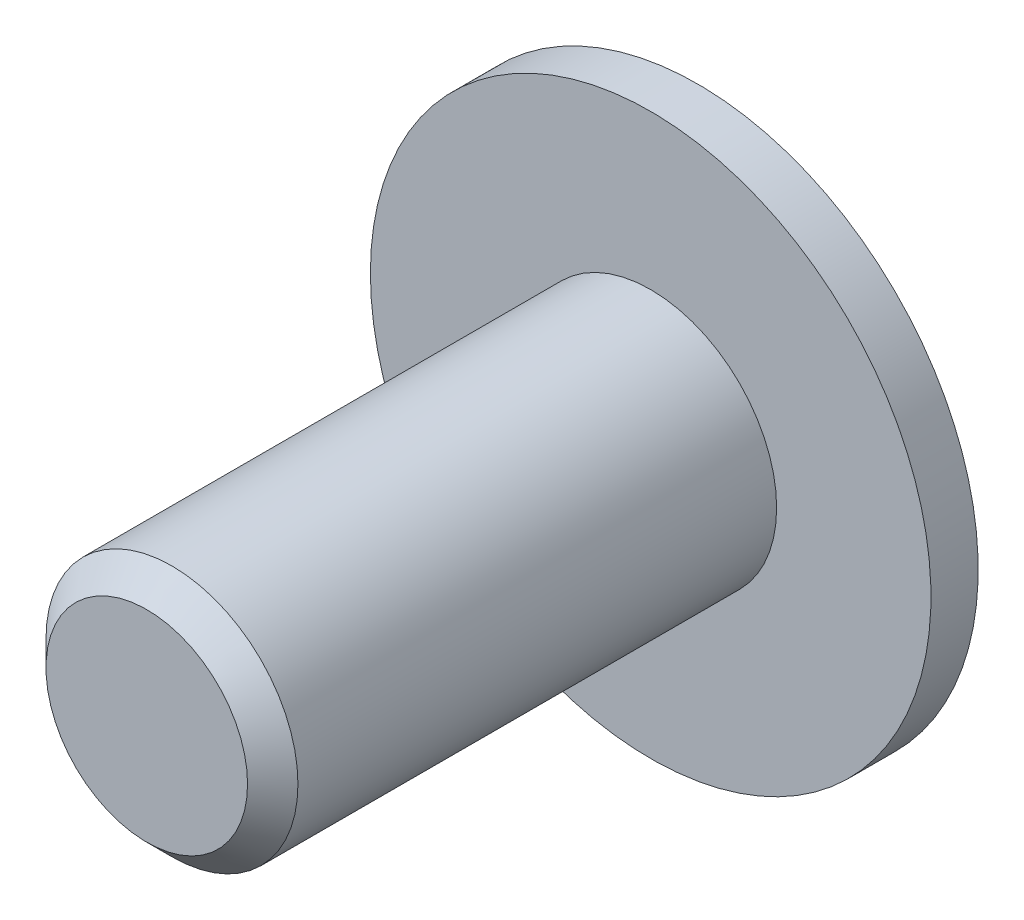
ISO-10303-21;
HEADER;
FILE_DESCRIPTION(('STEP AP214'),'2;1');
FILE_NAME('part.step','',(''),(''),'','','');
FILE_SCHEMA(('AUTOMOTIVE_DESIGN { 1 0 10303 214 1 1 1 1 }'));
ENDSEC;
DATA;
#1=APPLICATION_CONTEXT('core data for automotive mechanical design processes');
#2=APPLICATION_PROTOCOL_DEFINITION('international standard','automotive_design',2000,#1);
#3=PRODUCT_CONTEXT('',#1,'mechanical');
#4=PRODUCT('Part','Part','',(#3));
#5=PRODUCT_RELATED_PRODUCT_CATEGORY('part','',(#4));
#6=PRODUCT_DEFINITION_FORMATION('','',#4);
#7=PRODUCT_DEFINITION_CONTEXT('part definition',#1,'design');
#8=PRODUCT_DEFINITION('design','',#6,#7);
#9=PRODUCT_DEFINITION_SHAPE('','',#8);
#10=(LENGTH_UNIT() NAMED_UNIT(*) SI_UNIT(.MILLI.,.METRE.));
#11=(NAMED_UNIT(*) PLANE_ANGLE_UNIT() SI_UNIT($,.RADIAN.));
#12=(NAMED_UNIT(*) SI_UNIT($,.STERADIAN.) SOLID_ANGLE_UNIT());
#13=UNCERTAINTY_MEASURE_WITH_UNIT(LENGTH_MEASURE(1.E-05),#10,'distance_accuracy_value','');
#14=(GEOMETRIC_REPRESENTATION_CONTEXT(3) GLOBAL_UNCERTAINTY_ASSIGNED_CONTEXT((#13)) GLOBAL_UNIT_ASSIGNED_CONTEXT((#10,
#11,#12)) REPRESENTATION_CONTEXT('',''));
#15=CARTESIAN_POINT('',(0.,0.,0.));
#16=DIRECTION('',(0.,0.,1.));
#17=DIRECTION('',(1.,0.,0.));
#18=AXIS2_PLACEMENT_3D('',#15,#16,#17);
#19=CARTESIAN_POINT('',(0.,0.,-4.40000000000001));
#20=DIRECTION('',(0.,0.,1.));
#21=DIRECTION('',(1.,0.,0.));
#22=AXIS2_PLACEMENT_3D('',#19,#20,#21);
#23=PLANE('',#22);
#24=CARTESIAN_POINT('',(0.,0.,-4.40000000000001));
#25=DIRECTION('',(0.,0.,-1.));
#26=DIRECTION('',(-1.,0.,0.));
#27=AXIS2_PLACEMENT_3D('',#24,#25,#26);
#28=CIRCLE('',#27,4.06492341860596);
#29=CARTESIAN_POINT('',(-4.06492341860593,0.,-4.40000000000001));
#30=VERTEX_POINT('',#29);
#31=EDGE_CURVE('E150',#30,#30,#28,.T.);
#32=ORIENTED_EDGE('',*,*,#31,.T.);
#33=EDGE_LOOP('',(#32));
#34=FACE_BOUND('',#33,.T.);
#35=DIRECTION('',(-0.86602540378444,0.499999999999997,0.));
#36=VECTOR('',#35,1.);
#37=CARTESIAN_POINT('',(0.,2.88675134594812,-4.40000000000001));
#38=LINE('',#37,#36);
#39=CARTESIAN_POINT('',(2.50000000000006,1.44337567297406,-4.40000000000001));
#40=VERTEX_POINT('',#39);
#41=CARTESIAN_POINT('',(0.,2.88675134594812,-4.40000000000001));
#42=VERTEX_POINT('',#41);
#43=EDGE_CURVE('E49',#40,#42,#38,.T.);
#44=ORIENTED_EDGE('',*,*,#43,.T.);
#45=DIRECTION('',(-0.866025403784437,-0.500000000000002,0.));
#46=VECTOR('',#45,1.);
#47=CARTESIAN_POINT('',(0.,2.88675134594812,-4.40000000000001));
#48=LINE('',#47,#46);
#49=CARTESIAN_POINT('',(-2.49999999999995,1.44337567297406,-4.40000000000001));
#50=VERTEX_POINT('',#49);
#51=EDGE_CURVE('E120',#42,#50,#48,.T.);
#52=ORIENTED_EDGE('',*,*,#51,.T.);
#53=DIRECTION('',(0.,-1.,0.));
#54=VECTOR('',#53,1.);
#55=CARTESIAN_POINT('',(-2.49999999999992,-1.44337567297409,-4.40000000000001));
#56=LINE('',#55,#54);
#57=CARTESIAN_POINT('',(-2.49999999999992,-1.44337567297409,-4.40000000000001));
#58=VERTEX_POINT('',#57);
#59=EDGE_CURVE('E124',#50,#58,#56,.T.);
#60=ORIENTED_EDGE('',*,*,#59,.T.);
#61=DIRECTION('',(0.866025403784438,-0.500000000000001,0.));
#62=VECTOR('',#61,1.);
#63=CARTESIAN_POINT('',(0.,-2.88675134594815,-4.40000000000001));
#64=LINE('',#63,#62);
#65=CARTESIAN_POINT('',(0.,-2.88675134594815,-4.40000000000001));
#66=VERTEX_POINT('',#65);
#67=EDGE_CURVE('E127',#58,#66,#64,.T.);
#68=ORIENTED_EDGE('',*,*,#67,.T.);
#69=DIRECTION('',(0.86602540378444,0.499999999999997,0.));
#70=VECTOR('',#69,1.);
#71=CARTESIAN_POINT('',(0.,-2.88675134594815,-4.40000000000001));
#72=LINE('',#71,#70);
#73=CARTESIAN_POINT('',(2.50000000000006,-1.44337567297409,-4.40000000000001));
#74=VERTEX_POINT('',#73);
#75=EDGE_CURVE('E110',#66,#74,#72,.T.);
#76=ORIENTED_EDGE('',*,*,#75,.T.);
#77=DIRECTION('',(0.,1.,0.));
#78=VECTOR('',#77,1.);
#79=CARTESIAN_POINT('',(2.50000000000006,-1.44337567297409,-4.40000000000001));
#80=LINE('',#79,#78);
#81=EDGE_CURVE('E130',#74,#40,#80,.T.);
#82=ORIENTED_EDGE('',*,*,#81,.T.);
#83=EDGE_LOOP('',(#44,#52,#60,#68,#76,#82));
#84=FACE_BOUND('',#83,.T.);
#85=ADVANCED_FACE('F34',(#34,#84),#23,.F.);
#86=CARTESIAN_POINT('',(0.,0.,-0.574933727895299));
#87=DIRECTION('',(0.,0.,-1.));
#88=DIRECTION('',(-1.,0.,0.));
#89=AXIS2_PLACEMENT_3D('',#86,#87,#88);
#90=DEGENERATE_TOROIDAL_SURFACE('',#89,3.04,3.96,.T.);
#91=ORIENTED_EDGE('',*,*,#31,.F.);
#92=EDGE_LOOP('',(#91));
#93=FACE_BOUND('',#92,.T.);
#94=CARTESIAN_POINT('',(0.,0.,-1.5));
#95=DIRECTION('',(0.,0.,-1.));
#96=DIRECTION('',(-1.,0.,0.));
#97=AXIS2_PLACEMENT_3D('',#94,#95,#96);
#98=CIRCLE('',#97,6.8904353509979);
#99=CARTESIAN_POINT('',(-6.89043535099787,0.,-1.5));
#100=VERTEX_POINT('',#99);
#101=EDGE_CURVE('E147',#100,#100,#98,.T.);
#102=ORIENTED_EDGE('',*,*,#101,.T.);
#103=EDGE_LOOP('',(#102));
#104=FACE_BOUND('',#103,.T.);
#105=ADVANCED_FACE('F167',(#93,#104),#90,.T.);
#106=CARTESIAN_POINT('',(8.90000000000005,0.,-1.5));
#107=DIRECTION('',(0.,0.,1.));
#108=DIRECTION('',(1.,0.,0.));
#109=AXIS2_PLACEMENT_3D('',#106,#107,#108);
#110=PLANE('',#109);
#111=ORIENTED_EDGE('',*,*,#101,.F.);
#112=EDGE_LOOP('',(#111));
#113=FACE_BOUND('',#112,.T.);
#114=CARTESIAN_POINT('',(0.,0.,-1.5));
#115=DIRECTION('',(0.,0.,-1.));
#116=DIRECTION('',(-1.,0.,0.));
#117=AXIS2_PLACEMENT_3D('',#114,#115,#116);
#118=CIRCLE('',#117,8.9);
#119=CARTESIAN_POINT('',(-8.89999999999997,0.,-1.5));
#120=VERTEX_POINT('',#119);
#121=EDGE_CURVE('E144',#120,#120,#118,.T.);
#122=ORIENTED_EDGE('',*,*,#121,.T.);
#123=EDGE_LOOP('',(#122));
#124=FACE_BOUND('',#123,.T.);
#125=ADVANCED_FACE('F172',(#113,#124),#110,.F.);
#126=CARTESIAN_POINT('',(0.,0.,0.));
#127=DIRECTION('',(0.,0.,-1.));
#128=DIRECTION('',(-1.,0.,0.));
#129=AXIS2_PLACEMENT_3D('',#126,#127,#128);
#130=CYLINDRICAL_SURFACE('',#129,8.9);
#131=ORIENTED_EDGE('',*,*,#121,.F.);
#132=EDGE_LOOP('',(#131));
#133=FACE_BOUND('',#132,.T.);
#134=CARTESIAN_POINT('',(0.,0.,0.));
#135=DIRECTION('',(0.,0.,-1.));
#136=DIRECTION('',(-1.,0.,0.));
#137=AXIS2_PLACEMENT_3D('',#134,#135,#136);
#138=CIRCLE('',#137,8.9);
#139=CARTESIAN_POINT('',(-8.89999999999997,0.,0.));
#140=VERTEX_POINT('',#139);
#141=EDGE_CURVE('E141',#140,#140,#138,.T.);
#142=ORIENTED_EDGE('',*,*,#141,.T.);
#143=EDGE_LOOP('',(#142));
#144=FACE_BOUND('',#143,.T.);
#145=ADVANCED_FACE('F179',(#133,#144),#130,.T.);
#146=CARTESIAN_POINT('',(0.,0.,0.));
#147=DIRECTION('',(0.,0.,-1.));
#148=DIRECTION('',(-1.,0.,0.));
#149=AXIS2_PLACEMENT_3D('',#146,#147,#148);
#150=PLANE('',#149);
#151=CARTESIAN_POINT('',(0.,0.,0.));
#152=DIRECTION('',(0.,0.,1.));
#153=DIRECTION('',(1.,0.,0.));
#154=AXIS2_PLACEMENT_3D('',#151,#152,#153);
#155=CIRCLE('',#154,4.);
#156=CARTESIAN_POINT('',(4.00000000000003,0.,0.));
#157=VERTEX_POINT('',#156);
#158=EDGE_CURVE('E121',#157,#157,#155,.T.);
#159=ORIENTED_EDGE('',*,*,#158,.F.);
#160=EDGE_LOOP('',(#159));
#161=FACE_BOUND('',#160,.T.);
#162=ORIENTED_EDGE('',*,*,#141,.F.);
#163=EDGE_LOOP('',(#162));
#164=FACE_BOUND('',#163,.T.);
#165=ADVANCED_FACE('F183',(#161,#164),#150,.F.);
#166=CARTESIAN_POINT('',(0.,2.88675134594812,-1.80000000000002));
#167=DIRECTION('',(-0.499999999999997,-0.86602540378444,0.));
#168=DIRECTION('',(0.86602540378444,-0.499999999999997,0.));
#169=AXIS2_PLACEMENT_3D('',#166,#167,#168);
#170=PLANE('',#169);
#171=ORIENTED_EDGE('',*,*,#43,.F.);
#172=DIRECTION('',(0.,0.,-1.));
#173=VECTOR('',#172,1.);
#174=CARTESIAN_POINT('',(2.50000000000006,1.44337567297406,-1.80000000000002));
#175=LINE('',#174,#173);
#176=CARTESIAN_POINT('',(2.50000000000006,1.44337567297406,-1.80000000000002));
#177=VERTEX_POINT('',#176);
#178=EDGE_CURVE('E115',#177,#40,#175,.T.);
#179=ORIENTED_EDGE('',*,*,#178,.F.);
#180=DIRECTION('',(-0.86602540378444,0.499999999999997,0.));
#181=VECTOR('',#180,1.);
#182=CARTESIAN_POINT('',(0.,2.88675134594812,-1.80000000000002));
#183=LINE('',#182,#181);
#184=CARTESIAN_POINT('',(0.,2.88675134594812,-1.80000000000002));
#185=VERTEX_POINT('',#184);
#186=EDGE_CURVE('E133',#177,#185,#183,.T.);
#187=ORIENTED_EDGE('',*,*,#186,.T.);
#188=DIRECTION('',(0.,0.,-1.));
#189=VECTOR('',#188,1.);
#190=CARTESIAN_POINT('',(0.,2.88675134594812,-1.80000000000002));
#191=LINE('',#190,#189);
#192=EDGE_CURVE('E139',#185,#42,#191,.T.);
#193=ORIENTED_EDGE('',*,*,#192,.T.);
#194=EDGE_LOOP('',(#171,#179,#187,#193));
#195=FACE_BOUND('',#194,.T.);
#196=ADVANCED_FACE('F187',(#195),#170,.T.);
#197=CARTESIAN_POINT('',(0.,2.88675134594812,-1.80000000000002));
#198=DIRECTION('',(0.500000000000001,-0.866025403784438,0.));
#199=DIRECTION('',(0.866025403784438,0.500000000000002,0.));
#200=AXIS2_PLACEMENT_3D('',#197,#198,#199);
#201=PLANE('',#200);
#202=ORIENTED_EDGE('',*,*,#51,.F.);
#203=ORIENTED_EDGE('',*,*,#192,.F.);
#204=DIRECTION('',(-0.866025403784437,-0.500000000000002,0.));
#205=VECTOR('',#204,1.);
#206=CARTESIAN_POINT('',(0.,2.88675134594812,-1.80000000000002));
#207=LINE('',#206,#205);
#208=CARTESIAN_POINT('',(-2.49999999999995,1.44337567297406,-1.80000000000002));
#209=VERTEX_POINT('',#208);
#210=EDGE_CURVE('E88',#185,#209,#207,.T.);
#211=ORIENTED_EDGE('',*,*,#210,.T.);
#212=DIRECTION('',(0.,0.,-1.));
#213=VECTOR('',#212,1.);
#214=CARTESIAN_POINT('',(-2.49999999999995,1.44337567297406,-1.80000000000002));
#215=LINE('',#214,#213);
#216=EDGE_CURVE('E137',#209,#50,#215,.T.);
#217=ORIENTED_EDGE('',*,*,#216,.T.);
#218=EDGE_LOOP('',(#202,#203,#211,#217));
#219=FACE_BOUND('',#218,.T.);
#220=ADVANCED_FACE('F191',(#219),#201,.T.);
#221=CARTESIAN_POINT('',(-2.49999999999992,-1.44337567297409,-1.80000000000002));
#222=DIRECTION('',(1.,0.,0.));
#223=DIRECTION('',(0.,0.,-1.));
#224=AXIS2_PLACEMENT_3D('',#221,#222,#223);
#225=PLANE('',#224);
#226=ORIENTED_EDGE('',*,*,#59,.F.);
#227=ORIENTED_EDGE('',*,*,#216,.F.);
#228=DIRECTION('',(0.,-1.,0.));
#229=VECTOR('',#228,1.);
#230=CARTESIAN_POINT('',(-2.49999999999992,-1.44337567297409,-1.80000000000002));
#231=LINE('',#230,#229);
#232=CARTESIAN_POINT('',(-2.49999999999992,-1.44337567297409,-1.80000000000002));
#233=VERTEX_POINT('',#232);
#234=EDGE_CURVE('E106',#209,#233,#231,.T.);
#235=ORIENTED_EDGE('',*,*,#234,.T.);
#236=DIRECTION('',(0.,0.,-1.));
#237=VECTOR('',#236,1.);
#238=CARTESIAN_POINT('',(-2.49999999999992,-1.44337567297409,-1.80000000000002));
#239=LINE('',#238,#237);
#240=EDGE_CURVE('E103',#233,#58,#239,.T.);
#241=ORIENTED_EDGE('',*,*,#240,.T.);
#242=EDGE_LOOP('',(#226,#227,#235,#241));
#243=FACE_BOUND('',#242,.T.);
#244=ADVANCED_FACE('F194',(#243),#225,.T.);
#245=CARTESIAN_POINT('',(0.,-2.88675134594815,-1.80000000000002));
#246=DIRECTION('',(0.500000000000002,0.866025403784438,0.));
#247=DIRECTION('',(-0.866025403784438,0.500000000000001,0.));
#248=AXIS2_PLACEMENT_3D('',#245,#246,#247);
#249=PLANE('',#248);
#250=ORIENTED_EDGE('',*,*,#67,.F.);
#251=ORIENTED_EDGE('',*,*,#240,.F.);
#252=DIRECTION('',(0.866025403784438,-0.500000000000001,0.));
#253=VECTOR('',#252,1.);
#254=CARTESIAN_POINT('',(0.,-2.88675134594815,-1.80000000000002));
#255=LINE('',#254,#253);
#256=CARTESIAN_POINT('',(0.,-2.88675134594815,-1.80000000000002));
#257=VERTEX_POINT('',#256);
#258=EDGE_CURVE('E98',#233,#257,#255,.T.);
#259=ORIENTED_EDGE('',*,*,#258,.T.);
#260=DIRECTION('',(0.,0.,-1.));
#261=VECTOR('',#260,1.);
#262=CARTESIAN_POINT('',(0.,-2.88675134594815,-1.80000000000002));
#263=LINE('',#262,#261);
#264=EDGE_CURVE('E102',#257,#66,#263,.T.);
#265=ORIENTED_EDGE('',*,*,#264,.T.);
#266=EDGE_LOOP('',(#250,#251,#259,#265));
#267=FACE_BOUND('',#266,.T.);
#268=ADVANCED_FACE('F101',(#267),#249,.T.);
#269=CARTESIAN_POINT('',(0.,-2.88675134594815,-1.80000000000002));
#270=DIRECTION('',(-0.499999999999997,0.86602540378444,0.));
#271=DIRECTION('',(-0.86602540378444,-0.499999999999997,0.));
#272=AXIS2_PLACEMENT_3D('',#269,#270,#271);
#273=PLANE('',#272);
#274=ORIENTED_EDGE('',*,*,#75,.F.);
#275=ORIENTED_EDGE('',*,*,#264,.F.);
#276=DIRECTION('',(0.86602540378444,0.499999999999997,0.));
#277=VECTOR('',#276,1.);
#278=CARTESIAN_POINT('',(0.,-2.88675134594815,-1.80000000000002));
#279=LINE('',#278,#277);
#280=CARTESIAN_POINT('',(2.50000000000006,-1.44337567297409,-1.80000000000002));
#281=VERTEX_POINT('',#280);
#282=EDGE_CURVE('E105',#257,#281,#279,.T.);
#283=ORIENTED_EDGE('',*,*,#282,.T.);
#284=DIRECTION('',(0.,0.,-1.));
#285=VECTOR('',#284,1.);
#286=CARTESIAN_POINT('',(2.50000000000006,-1.44337567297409,-1.80000000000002));
#287=LINE('',#286,#285);
#288=EDGE_CURVE('E79',#281,#74,#287,.T.);
#289=ORIENTED_EDGE('',*,*,#288,.T.);
#290=EDGE_LOOP('',(#274,#275,#283,#289));
#291=FACE_BOUND('',#290,.T.);
#292=ADVANCED_FACE('F108',(#291),#273,.T.);
#293=CARTESIAN_POINT('',(2.50000000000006,-1.44337567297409,-1.80000000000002));
#294=DIRECTION('',(-1.,0.,0.));
#295=DIRECTION('',(0.,0.,1.));
#296=AXIS2_PLACEMENT_3D('',#293,#294,#295);
#297=PLANE('',#296);
#298=ORIENTED_EDGE('',*,*,#81,.F.);
#299=ORIENTED_EDGE('',*,*,#288,.F.);
#300=DIRECTION('',(0.,1.,0.));
#301=VECTOR('',#300,1.);
#302=CARTESIAN_POINT('',(2.50000000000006,-1.44337567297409,-1.80000000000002));
#303=LINE('',#302,#301);
#304=EDGE_CURVE('E57',#281,#177,#303,.T.);
#305=ORIENTED_EDGE('',*,*,#304,.T.);
#306=ORIENTED_EDGE('',*,*,#178,.T.);
#307=EDGE_LOOP('',(#298,#299,#305,#306));
#308=FACE_BOUND('',#307,.T.);
#309=ADVANCED_FACE('F203',(#308),#297,.T.);
#310=CARTESIAN_POINT('',(2.50000000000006,1.44337567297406,-1.80000000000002));
#311=DIRECTION('',(0.,0.,1.));
#312=DIRECTION('',(1.,0.,0.));
#313=AXIS2_PLACEMENT_3D('',#310,#311,#312);
#314=PLANE('',#313);
#315=ORIENTED_EDGE('',*,*,#186,.F.);
#316=ORIENTED_EDGE('',*,*,#304,.F.);
#317=ORIENTED_EDGE('',*,*,#282,.F.);
#318=ORIENTED_EDGE('',*,*,#258,.F.);
#319=ORIENTED_EDGE('',*,*,#234,.F.);
#320=ORIENTED_EDGE('',*,*,#210,.F.);
#321=EDGE_LOOP('',(#315,#316,#317,#318,#319,#320));
#322=FACE_BOUND('',#321,.T.);
#323=ADVANCED_FACE('F113',(#322),#314,.F.);
#324=CARTESIAN_POINT('',(0.,0.,16.));
#325=DIRECTION('',(0.,0.,1.));
#326=DIRECTION('',(1.,0.,0.));
#327=AXIS2_PLACEMENT_3D('',#324,#325,#326);
#328=PLANE('',#327);
#329=CARTESIAN_POINT('',(0.,0.,16.));
#330=DIRECTION('',(0.,0.,1.));
#331=DIRECTION('',(1.,0.,0.));
#332=AXIS2_PLACEMENT_3D('',#329,#330,#331);
#333=CIRCLE('',#332,3.2);
#334=CARTESIAN_POINT('',(3.20000000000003,0.,16.));
#335=VERTEX_POINT('',#334);
#336=EDGE_CURVE('E42',#335,#335,#333,.T.);
#337=ORIENTED_EDGE('',*,*,#336,.T.);
#338=EDGE_LOOP('',(#337));
#339=FACE_BOUND('',#338,.T.);
#340=ADVANCED_FACE('F155',(#339),#328,.T.);
#341=CARTESIAN_POINT('',(0.,0.,0.));
#342=DIRECTION('',(0.,0.,1.));
#343=DIRECTION('',(1.,0.,0.));
#344=AXIS2_PLACEMENT_3D('',#341,#342,#343);
#345=CYLINDRICAL_SURFACE('',#344,4.);
#346=CARTESIAN_POINT('',(0.,0.,15.2));
#347=DIRECTION('',(0.,0.,1.));
#348=DIRECTION('',(1.,0.,0.));
#349=AXIS2_PLACEMENT_3D('',#346,#347,#348);
#350=CIRCLE('',#349,4.);
#351=CARTESIAN_POINT('',(4.00000000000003,0.,15.2));
#352=VERTEX_POINT('',#351);
#353=EDGE_CURVE('E11',#352,#352,#350,.F.);
#354=ORIENTED_EDGE('',*,*,#353,.T.);
#355=EDGE_LOOP('',(#354));
#356=FACE_BOUND('',#355,.T.);
#357=ORIENTED_EDGE('',*,*,#158,.T.);
#358=EDGE_LOOP('',(#357));
#359=FACE_BOUND('',#358,.T.);
#360=ADVANCED_FACE('F158',(#356,#359),#345,.T.);
#361=CARTESIAN_POINT('',(0.,0.,16.));
#362=DIRECTION('',(0.,0.,-1.));
#363=DIRECTION('',(-1.,0.,0.));
#364=AXIS2_PLACEMENT_3D('',#361,#362,#363);
#365=CONICAL_SURFACE('',#364,3.2,0.785398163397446);
#366=ORIENTED_EDGE('',*,*,#353,.F.);
#367=EDGE_LOOP('',(#366));
#368=FACE_BOUND('',#367,.T.);
#369=ORIENTED_EDGE('',*,*,#336,.F.);
#370=EDGE_LOOP('',(#369));
#371=FACE_BOUND('',#370,.T.);
#372=ADVANCED_FACE('F36',(#368,#371),#365,.T.);
#373=CLOSED_SHELL('',(#85,#105,#125,#145,#165,#196,#220,#244,#268,#292,#309,#323,#340,#360,#372));
#374=MANIFOLD_SOLID_BREP('B2',#373);
#375=ADVANCED_BREP_SHAPE_REPRESENTATION('',(#18,#374),#14);
#376=SHAPE_DEFINITION_REPRESENTATION(#9,#375);
ENDSEC;
END-ISO-10303-21;
